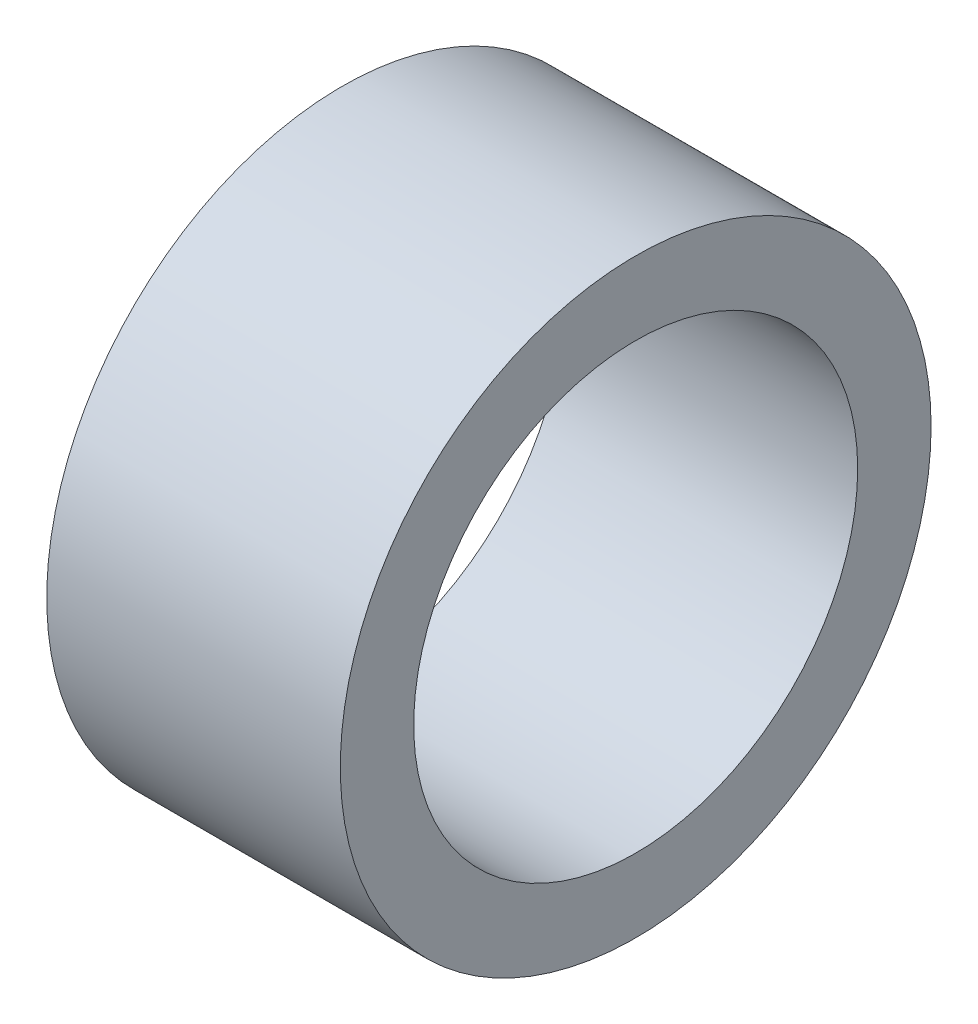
from build123d import *

# Parameters (mm, degrees)
SKETCH1_R           = 4.025
SKETCH1_R_2         = 3.025
BOSS_EXTRUDE1_DEPTH = 4


with BuildPart() as part:
    # Sketch1 → Boss-Extrude1 (new body)
    with BuildSketch(Plane(origin=(0, 0, 0), x_dir=(0, 0, -1), z_dir=(1, 0, 0))):
        Circle(SKETCH1_R)
        Circle(SKETCH1_R_2, mode=Mode.SUBTRACT)
    extrude(amount=BOSS_EXTRUDE1_DEPTH)


solid = part.part
